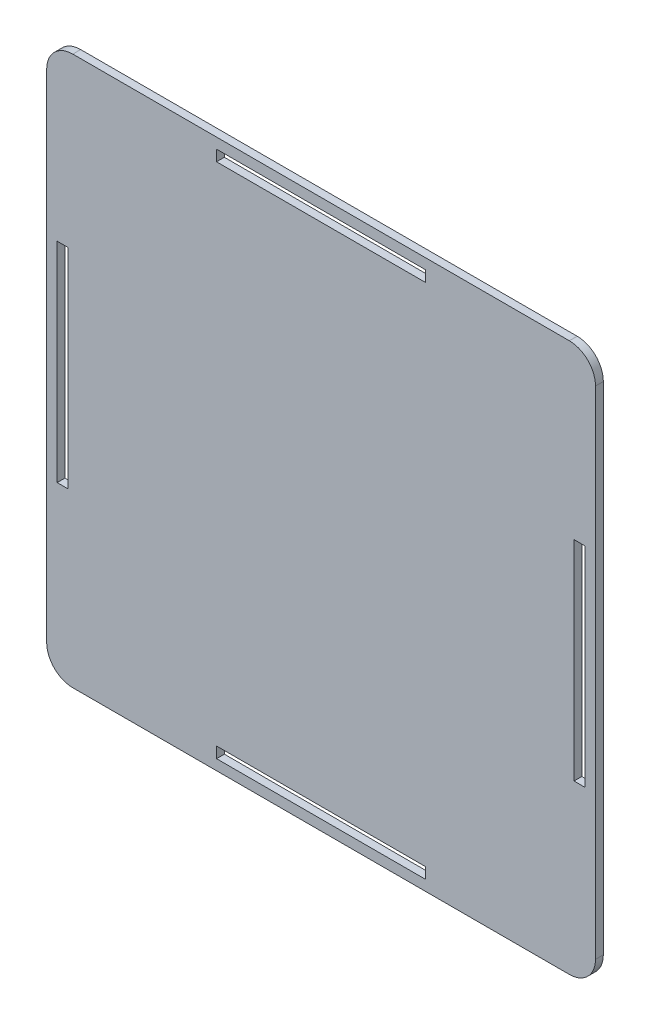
from build123d import *

# Parameters (mm, degrees)
ESQUISSE1_W        = 2.1
ESQUISSE1_H        = 40
ESQUISSE1_W_2      = 40
ESQUISSE1_H_2      = 2.1
BOSS_EXTRU_1_DEPTH = 1.5


with BuildPart() as part:
    # Esquisse1 → Boss.-Extru.1 (new body)
    with BuildSketch(Plane.XY):
        with BuildLine():
            Line((-47.5, 52.5), (47.5, 52.5))
            ThreePointArc((47.5, 52.5), (51.035533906, 51.035533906), (52.5, 47.5))
            Line((52.5, 47.5), (52.5, -47.5))
            ThreePointArc((52.5, -47.5), (51.035533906, -51.035533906), (47.5, -52.5))
            Line((47.5, -52.5), (-47.5, -52.5))
            ThreePointArc((-47.5, -52.5), (-51.035533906, -51.035533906), (-52.5, -47.5))
            Line((-52.5, -47.5), (-52.5, 47.5))
            ThreePointArc((-52.5, 47.5), (-51.035533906, 51.035533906), (-47.5, 52.5))
        make_face()
        with Locations((-49.45, 0)):
            Rectangle(ESQUISSE1_W, ESQUISSE1_H, mode=Mode.SUBTRACT)
        with Locations((0, 49.45)):
            Rectangle(ESQUISSE1_W_2, ESQUISSE1_H_2, mode=Mode.SUBTRACT)
        with Locations((49.45, 0)):
            Rectangle(ESQUISSE1_W, ESQUISSE1_H, mode=Mode.SUBTRACT)
        with Locations((0, -49.45)):
            Rectangle(ESQUISSE1_W_2, ESQUISSE1_H_2, mode=Mode.SUBTRACT)
    extrude(amount=BOSS_EXTRU_1_DEPTH)


solid = part.part
